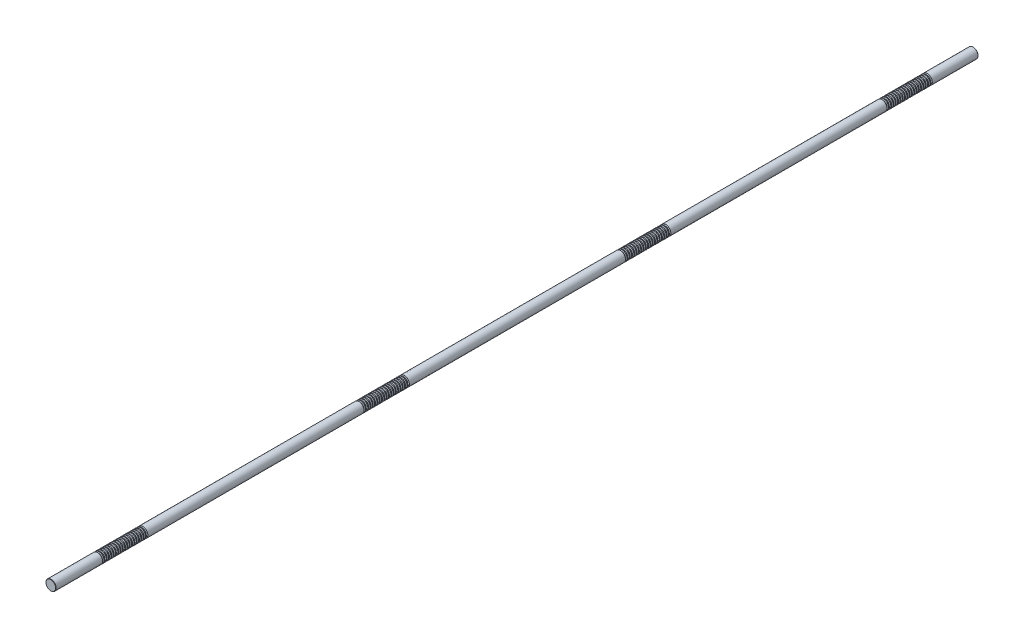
from build123d import *

# Parameters (mm, degrees)
SKETCH1_R           = 11
BOSS_EXTRUDE1_DEPTH = 1000
CHAMFER1_SIZE       = 0.55
LPATTERN1_COUNT     = 20
LPATTERN1_PITCH     = 5
LPATTERN2_COUNT     = 4
LPATTERN2_PITCH     = 567


with BuildPart() as part:
    # Sketch1 → Boss-Extrude1 (new, symmetric)
    with BuildSketch(Plane.XY):
        Circle(SKETCH1_R)
    extrude(amount=BOSS_EXTRUDE1_DEPTH, both=True)

    # Chamfer1
    chamfer1_edges = [part.edges().sort_by_distance(p)[0] for p in [
        (-11, 0, -1000),
        (-11, 0, 1000),
    ]]
    chamfer(chamfer1_edges, length=CHAMFER1_SIZE)

    # Sketch2 → Cut-Revolve1 (revolve, cut)
    with BuildSketch(Plane(origin=(0, 0, 0), x_dir=(0, 0, -1), z_dir=(1, 0, 0)), mode=Mode.PRIVATE) as cut_revolve1_sk:
        Polygon((900.36843014, 11), (897.13156986, 11), (897.86843014, 8.25), (899.63156986, 8.25), align=None)
    cut_revolve1 = revolve(cut_revolve1_sk.sketch.rotate(Axis((0, 0, 1000), (0, 0, -1)), 90), axis=Axis((0, 0, 1000), (0, 0, -1)), mode=Mode.SUBTRACT)

    # LPattern1: Cut-Revolve1 ×20
    with Locations(*[(0, 0, i * LPATTERN1_PITCH) for i in range(1, LPATTERN1_COUNT)]):
        add(cut_revolve1, mode=Mode.SUBTRACT)

    # LPattern2: Cut-Revolve1 ×4
    with Locations(*[(0, 0, i * LPATTERN2_PITCH) for i in range(1, LPATTERN2_COUNT)]):
        add(cut_revolve1, mode=Mode.SUBTRACT)

    # LPattern2 copy 1 sketch → LPattern2 copy 1 (revolve, cut)
    with BuildSketch(Plane(origin=(0, 0, 572), x_dir=(0, 0, -1), z_dir=(1, 0, 0))):
        Polygon((900.36843014, 11), (897.13156986, 11), (897.86843014, 8.25), (899.63156986, 8.25), align=None)
    revolve(axis=Axis((0, 0, 1572), (0, 0, -1)), mode=Mode.SUBTRACT)

    # LPattern2 copy 2 sketch → LPattern2 copy 2 (revolve, cut)
    with BuildSketch(Plane(origin=(0, 0, 1139), x_dir=(0, 0, -1), z_dir=(1, 0, 0))):
        Polygon((900.36843014, 11), (897.13156986, 11), (897.86843014, 8.25), (899.63156986, 8.25), align=None)
    revolve(axis=Axis((0, 0, 2139), (0, 0, -1)), mode=Mode.SUBTRACT)

    # LPattern2 copy 3 sketch → LPattern2 copy 3 (revolve, cut)
    with BuildSketch(Plane(origin=(0, 0, 1706), x_dir=(0, 0, -1), z_dir=(1, 0, 0))):
        Polygon((900.36843014, 11), (897.13156986, 11), (897.86843014, 8.25), (899.63156986, 8.25), align=None)
    revolve(axis=Axis((0, 0, 2706), (0, 0, -1)), mode=Mode.SUBTRACT)

    # LPattern2 copy 4 sketch → LPattern2 copy 4 (revolve, cut)
    with BuildSketch(Plane(origin=(0, 0, 577), x_dir=(0, 0, -1), z_dir=(1, 0, 0))):
        Polygon((900.36843014, 11), (897.13156986, 11), (897.86843014, 8.25), (899.63156986, 8.25), align=None)
    revolve(axis=Axis((0, 0, 1577), (0, 0, -1)), mode=Mode.SUBTRACT)

    # LPattern2 copy 5 sketch → LPattern2 copy 5 (revolve, cut)
    with BuildSketch(Plane(origin=(0, 0, 1144), x_dir=(0, 0, -1), z_dir=(1, 0, 0))):
        Polygon((900.36843014, 11), (897.13156986, 11), (897.86843014, 8.25), (899.63156986, 8.25), align=None)
    revolve(axis=Axis((0, 0, 2144), (0, 0, -1)), mode=Mode.SUBTRACT)

    # LPattern2 copy 6 sketch → LPattern2 copy 6 (revolve, cut)
    with BuildSketch(Plane(origin=(0, 0, 1711), x_dir=(0, 0, -1), z_dir=(1, 0, 0))):
        Polygon((900.36843014, 11), (897.13156986, 11), (897.86843014, 8.25), (899.63156986, 8.25), align=None)
    revolve(axis=Axis((0, 0, 2711), (0, 0, -1)), mode=Mode.SUBTRACT)

    # LPattern2 copy 7 sketch → LPattern2 copy 7 (revolve, cut)
    with BuildSketch(Plane(origin=(0, 0, 582), x_dir=(0, 0, -1), z_dir=(1, 0, 0))):
        Polygon((900.36843014, 11), (897.13156986, 11), (897.86843014, 8.25), (899.63156986, 8.25), align=None)
    revolve(axis=Axis((0, 0, 1582), (0, 0, -1)), mode=Mode.SUBTRACT)

    # LPattern2 copy 8 sketch → LPattern2 copy 8 (revolve, cut)
    with BuildSketch(Plane(origin=(0, 0, 1149), x_dir=(0, 0, -1), z_dir=(1, 0, 0))):
        Polygon((900.36843014, 11), (897.13156986, 11), (897.86843014, 8.25), (899.63156986, 8.25), align=None)
    revolve(axis=Axis((0, 0, 2149), (0, 0, -1)), mode=Mode.SUBTRACT)

    # LPattern2 copy 9 sketch → LPattern2 copy 9 (revolve, cut)
    with BuildSketch(Plane(origin=(0, 0, 1716), x_dir=(0, 0, -1), z_dir=(1, 0, 0))):
        Polygon((900.36843014, 11), (897.13156986, 11), (897.86843014, 8.25), (899.63156986, 8.25), align=None)
    revolve(axis=Axis((0, 0, 2716), (0, 0, -1)), mode=Mode.SUBTRACT)

    # LPattern2 copy 10 sketch → LPattern2 copy 10 (revolve, cut)
    with BuildSketch(Plane(origin=(0, 0, 587), x_dir=(0, 0, -1), z_dir=(1, 0, 0))):
        Polygon((900.36843014, 11), (897.13156986, 11), (897.86843014, 8.25), (899.63156986, 8.25), align=None)
    revolve(axis=Axis((0, 0, 1587), (0, 0, -1)), mode=Mode.SUBTRACT)

    # LPattern2 copy 11 sketch → LPattern2 copy 11 (revolve, cut)
    with BuildSketch(Plane(origin=(0, 0, 1154), x_dir=(0, 0, -1), z_dir=(1, 0, 0))):
        Polygon((900.36843014, 11), (897.13156986, 11), (897.86843014, 8.25), (899.63156986, 8.25), align=None)
    revolve(axis=Axis((0, 0, 2154), (0, 0, -1)), mode=Mode.SUBTRACT)

    # LPattern2 copy 12 sketch → LPattern2 copy 12 (revolve, cut)
    with BuildSketch(Plane(origin=(0, 0, 1721), x_dir=(0, 0, -1), z_dir=(1, 0, 0))):
        Polygon((900.36843014, 11), (897.13156986, 11), (897.86843014, 8.25), (899.63156986, 8.25), align=None)
    revolve(axis=Axis((0, 0, 2721), (0, 0, -1)), mode=Mode.SUBTRACT)

    # LPattern2 copy 13 sketch → LPattern2 copy 13 (revolve, cut)
    with BuildSketch(Plane(origin=(0, 0, 592), x_dir=(0, 0, -1), z_dir=(1, 0, 0))):
        Polygon((900.36843014, 11), (897.13156986, 11), (897.86843014, 8.25), (899.63156986, 8.25), align=None)
    revolve(axis=Axis((0, 0, 1592), (0, 0, -1)), mode=Mode.SUBTRACT)

    # LPattern2 copy 14 sketch → LPattern2 copy 14 (revolve, cut)
    with BuildSketch(Plane(origin=(0, 0, 1159), x_dir=(0, 0, -1), z_dir=(1, 0, 0))):
        Polygon((900.36843014, 11), (897.13156986, 11), (897.86843014, 8.25), (899.63156986, 8.25), align=None)
    revolve(axis=Axis((0, 0, 2159), (0, 0, -1)), mode=Mode.SUBTRACT)

    # LPattern2 copy 15 sketch → LPattern2 copy 15 (revolve, cut)
    with BuildSketch(Plane(origin=(0, 0, 1726), x_dir=(0, 0, -1), z_dir=(1, 0, 0))):
        Polygon((900.36843014, 11), (897.13156986, 11), (897.86843014, 8.25), (899.63156986, 8.25), align=None)
    revolve(axis=Axis((0, 0, 2726), (0, 0, -1)), mode=Mode.SUBTRACT)

    # LPattern2 copy 16 sketch → LPattern2 copy 16 (revolve, cut)
    with BuildSketch(Plane(origin=(0, 0, 597), x_dir=(0, 0, -1), z_dir=(1, 0, 0))):
        Polygon((900.36843014, 11), (897.13156986, 11), (897.86843014, 8.25), (899.63156986, 8.25), align=None)
    revolve(axis=Axis((0, 0, 1597), (0, 0, -1)), mode=Mode.SUBTRACT)

    # LPattern2 copy 17 sketch → LPattern2 copy 17 (revolve, cut)
    with BuildSketch(Plane(origin=(0, 0, 1164), x_dir=(0, 0, -1), z_dir=(1, 0, 0))):
        Polygon((900.36843014, 11), (897.13156986, 11), (897.86843014, 8.25), (899.63156986, 8.25), align=None)
    revolve(axis=Axis((0, 0, 2164), (0, 0, -1)), mode=Mode.SUBTRACT)

    # LPattern2 copy 18 sketch → LPattern2 copy 18 (revolve, cut)
    with BuildSketch(Plane(origin=(0, 0, 1731), x_dir=(0, 0, -1), z_dir=(1, 0, 0))):
        Polygon((900.36843014, 11), (897.13156986, 11), (897.86843014, 8.25), (899.63156986, 8.25), align=None)
    revolve(axis=Axis((0, 0, 2731), (0, 0, -1)), mode=Mode.SUBTRACT)

    # LPattern2 copy 19 sketch → LPattern2 copy 19 (revolve, cut)
    with BuildSketch(Plane(origin=(0, 0, 602), x_dir=(0, 0, -1), z_dir=(1, 0, 0))):
        Polygon((900.36843014, 11), (897.13156986, 11), (897.86843014, 8.25), (899.63156986, 8.25), align=None)
    revolve(axis=Axis((0, 0, 1602), (0, 0, -1)), mode=Mode.SUBTRACT)

    # LPattern2 copy 20 sketch → LPattern2 copy 20 (revolve, cut)
    with BuildSketch(Plane(origin=(0, 0, 1169), x_dir=(0, 0, -1), z_dir=(1, 0, 0))):
        Polygon((900.36843014, 11), (897.13156986, 11), (897.86843014, 8.25), (899.63156986, 8.25), align=None)
    revolve(axis=Axis((0, 0, 2169), (0, 0, -1)), mode=Mode.SUBTRACT)

    # LPattern2 copy 21 sketch → LPattern2 copy 21 (revolve, cut)
    with BuildSketch(Plane(origin=(0, 0, 1736), x_dir=(0, 0, -1), z_dir=(1, 0, 0))):
        Polygon((900.36843014, 11), (897.13156986, 11), (897.86843014, 8.25), (899.63156986, 8.25), align=None)
    revolve(axis=Axis((0, 0, 2736), (0, 0, -1)), mode=Mode.SUBTRACT)

    # LPattern2 copy 22 sketch → LPattern2 copy 22 (revolve, cut)
    with BuildSketch(Plane(origin=(0, 0, 607), x_dir=(0, 0, -1), z_dir=(1, 0, 0))):
        Polygon((900.36843014, 11), (897.13156986, 11), (897.86843014, 8.25), (899.63156986, 8.25), align=None)
    revolve(axis=Axis((0, 0, 1607), (0, 0, -1)), mode=Mode.SUBTRACT)

    # LPattern2 copy 23 sketch → LPattern2 copy 23 (revolve, cut)
    with BuildSketch(Plane(origin=(0, 0, 1174), x_dir=(0, 0, -1), z_dir=(1, 0, 0))):
        Polygon((900.36843014, 11), (897.13156986, 11), (897.86843014, 8.25), (899.63156986, 8.25), align=None)
    revolve(axis=Axis((0, 0, 2174), (0, 0, -1)), mode=Mode.SUBTRACT)

    # LPattern2 copy 24 sketch → LPattern2 copy 24 (revolve, cut)
    with BuildSketch(Plane(origin=(0, 0, 1741), x_dir=(0, 0, -1), z_dir=(1, 0, 0))):
        Polygon((900.36843014, 11), (897.13156986, 11), (897.86843014, 8.25), (899.63156986, 8.25), align=None)
    revolve(axis=Axis((0, 0, 2741), (0, 0, -1)), mode=Mode.SUBTRACT)

    # LPattern2 copy 25 sketch → LPattern2 copy 25 (revolve, cut)
    with BuildSketch(Plane(origin=(0, 0, 612), x_dir=(0, 0, -1), z_dir=(1, 0, 0))):
        Polygon((900.36843014, 11), (897.13156986, 11), (897.86843014, 8.25), (899.63156986, 8.25), align=None)
    revolve(axis=Axis((0, 0, 1612), (0, 0, -1)), mode=Mode.SUBTRACT)

    # LPattern2 copy 26 sketch → LPattern2 copy 26 (revolve, cut)
    with BuildSketch(Plane(origin=(0, 0, 1179), x_dir=(0, 0, -1), z_dir=(1, 0, 0))):
        Polygon((900.36843014, 11), (897.13156986, 11), (897.86843014, 8.25), (899.63156986, 8.25), align=None)
    revolve(axis=Axis((0, 0, 2179), (0, 0, -1)), mode=Mode.SUBTRACT)

    # LPattern2 copy 27 sketch → LPattern2 copy 27 (revolve, cut)
    with BuildSketch(Plane(origin=(0, 0, 1746), x_dir=(0, 0, -1), z_dir=(1, 0, 0))):
        Polygon((900.36843014, 11), (897.13156986, 11), (897.86843014, 8.25), (899.63156986, 8.25), align=None)
    revolve(axis=Axis((0, 0, 2746), (0, 0, -1)), mode=Mode.SUBTRACT)

    # LPattern2 copy 28 sketch → LPattern2 copy 28 (revolve, cut)
    with BuildSketch(Plane(origin=(0, 0, 617), x_dir=(0, 0, -1), z_dir=(1, 0, 0))):
        Polygon((900.36843014, 11), (897.13156986, 11), (897.86843014, 8.25), (899.63156986, 8.25), align=None)
    revolve(axis=Axis((0, 0, 1617), (0, 0, -1)), mode=Mode.SUBTRACT)

    # LPattern2 copy 29 sketch → LPattern2 copy 29 (revolve, cut)
    with BuildSketch(Plane(origin=(0, 0, 1184), x_dir=(0, 0, -1), z_dir=(1, 0, 0))):
        Polygon((900.36843014, 11), (897.13156986, 11), (897.86843014, 8.25), (899.63156986, 8.25), align=None)
    revolve(axis=Axis((0, 0, 2184), (0, 0, -1)), mode=Mode.SUBTRACT)

    # LPattern2 copy 30 sketch → LPattern2 copy 30 (revolve, cut)
    with BuildSketch(Plane(origin=(0, 0, 1751), x_dir=(0, 0, -1), z_dir=(1, 0, 0))):
        Polygon((900.36843014, 11), (897.13156986, 11), (897.86843014, 8.25), (899.63156986, 8.25), align=None)
    revolve(axis=Axis((0, 0, 2751), (0, 0, -1)), mode=Mode.SUBTRACT)

    # LPattern2 copy 31 sketch → LPattern2 copy 31 (revolve, cut)
    with BuildSketch(Plane(origin=(0, 0, 622), x_dir=(0, 0, -1), z_dir=(1, 0, 0))):
        Polygon((900.36843014, 11), (897.13156986, 11), (897.86843014, 8.25), (899.63156986, 8.25), align=None)
    revolve(axis=Axis((0, 0, 1622), (0, 0, -1)), mode=Mode.SUBTRACT)

    # LPattern2 copy 32 sketch → LPattern2 copy 32 (revolve, cut)
    with BuildSketch(Plane(origin=(0, 0, 1189), x_dir=(0, 0, -1), z_dir=(1, 0, 0))):
        Polygon((900.36843014, 11), (897.13156986, 11), (897.86843014, 8.25), (899.63156986, 8.25), align=None)
    revolve(axis=Axis((0, 0, 2189), (0, 0, -1)), mode=Mode.SUBTRACT)

    # LPattern2 copy 33 sketch → LPattern2 copy 33 (revolve, cut)
    with BuildSketch(Plane(origin=(0, 0, 1756), x_dir=(0, 0, -1), z_dir=(1, 0, 0))):
        Polygon((900.36843014, 11), (897.13156986, 11), (897.86843014, 8.25), (899.63156986, 8.25), align=None)
    revolve(axis=Axis((0, 0, 2756), (0, 0, -1)), mode=Mode.SUBTRACT)

    # LPattern2 copy 34 sketch → LPattern2 copy 34 (revolve, cut)
    with BuildSketch(Plane(origin=(0, 0, 627), x_dir=(0, 0, -1), z_dir=(1, 0, 0))):
        Polygon((900.36843014, 11), (897.13156986, 11), (897.86843014, 8.25), (899.63156986, 8.25), align=None)
    revolve(axis=Axis((0, 0, 1627), (0, 0, -1)), mode=Mode.SUBTRACT)

    # LPattern2 copy 35 sketch → LPattern2 copy 35 (revolve, cut)
    with BuildSketch(Plane(origin=(0, 0, 1194), x_dir=(0, 0, -1), z_dir=(1, 0, 0))):
        Polygon((900.36843014, 11), (897.13156986, 11), (897.86843014, 8.25), (899.63156986, 8.25), align=None)
    revolve(axis=Axis((0, 0, 2194), (0, 0, -1)), mode=Mode.SUBTRACT)

    # LPattern2 copy 36 sketch → LPattern2 copy 36 (revolve, cut)
    with BuildSketch(Plane(origin=(0, 0, 1761), x_dir=(0, 0, -1), z_dir=(1, 0, 0))):
        Polygon((900.36843014, 11), (897.13156986, 11), (897.86843014, 8.25), (899.63156986, 8.25), align=None)
    revolve(axis=Axis((0, 0, 2761), (0, 0, -1)), mode=Mode.SUBTRACT)

    # LPattern2 copy 37 sketch → LPattern2 copy 37 (revolve, cut)
    with BuildSketch(Plane(origin=(0, 0, 632), x_dir=(0, 0, -1), z_dir=(1, 0, 0))):
        Polygon((900.36843014, 11), (897.13156986, 11), (897.86843014, 8.25), (899.63156986, 8.25), align=None)
    revolve(axis=Axis((0, 0, 1632), (0, 0, -1)), mode=Mode.SUBTRACT)

    # LPattern2 copy 38 sketch → LPattern2 copy 38 (revolve, cut)
    with BuildSketch(Plane(origin=(0, 0, 1199), x_dir=(0, 0, -1), z_dir=(1, 0, 0))):
        Polygon((900.36843014, 11), (897.13156986, 11), (897.86843014, 8.25), (899.63156986, 8.25), align=None)
    revolve(axis=Axis((0, 0, 2199), (0, 0, -1)), mode=Mode.SUBTRACT)

    # LPattern2 copy 39 sketch → LPattern2 copy 39 (revolve, cut)
    with BuildSketch(Plane(origin=(0, 0, 1766), x_dir=(0, 0, -1), z_dir=(1, 0, 0))):
        Polygon((900.36843014, 11), (897.13156986, 11), (897.86843014, 8.25), (899.63156986, 8.25), align=None)
    revolve(axis=Axis((0, 0, 2766), (0, 0, -1)), mode=Mode.SUBTRACT)

    # LPattern2 copy 40 sketch → LPattern2 copy 40 (revolve, cut)
    with BuildSketch(Plane(origin=(0, 0, 637), x_dir=(0, 0, -1), z_dir=(1, 0, 0))):
        Polygon((900.36843014, 11), (897.13156986, 11), (897.86843014, 8.25), (899.63156986, 8.25), align=None)
    revolve(axis=Axis((0, 0, 1637), (0, 0, -1)), mode=Mode.SUBTRACT)

    # LPattern2 copy 41 sketch → LPattern2 copy 41 (revolve, cut)
    with BuildSketch(Plane(origin=(0, 0, 1204), x_dir=(0, 0, -1), z_dir=(1, 0, 0))):
        Polygon((900.36843014, 11), (897.13156986, 11), (897.86843014, 8.25), (899.63156986, 8.25), align=None)
    revolve(axis=Axis((0, 0, 2204), (0, 0, -1)), mode=Mode.SUBTRACT)

    # LPattern2 copy 42 sketch → LPattern2 copy 42 (revolve, cut)
    with BuildSketch(Plane(origin=(0, 0, 1771), x_dir=(0, 0, -1), z_dir=(1, 0, 0))):
        Polygon((900.36843014, 11), (897.13156986, 11), (897.86843014, 8.25), (899.63156986, 8.25), align=None)
    revolve(axis=Axis((0, 0, 2771), (0, 0, -1)), mode=Mode.SUBTRACT)

    # LPattern2 copy 43 sketch → LPattern2 copy 43 (revolve, cut)
    with BuildSketch(Plane(origin=(0, 0, 642), x_dir=(0, 0, -1), z_dir=(1, 0, 0))):
        Polygon((900.36843014, 11), (897.13156986, 11), (897.86843014, 8.25), (899.63156986, 8.25), align=None)
    revolve(axis=Axis((0, 0, 1642), (0, 0, -1)), mode=Mode.SUBTRACT)

    # LPattern2 copy 44 sketch → LPattern2 copy 44 (revolve, cut)
    with BuildSketch(Plane(origin=(0, 0, 1209), x_dir=(0, 0, -1), z_dir=(1, 0, 0))):
        Polygon((900.36843014, 11), (897.13156986, 11), (897.86843014, 8.25), (899.63156986, 8.25), align=None)
    revolve(axis=Axis((0, 0, 2209), (0, 0, -1)), mode=Mode.SUBTRACT)

    # LPattern2 copy 45 sketch → LPattern2 copy 45 (revolve, cut)
    with BuildSketch(Plane(origin=(0, 0, 1776), x_dir=(0, 0, -1), z_dir=(1, 0, 0))):
        Polygon((900.36843014, 11), (897.13156986, 11), (897.86843014, 8.25), (899.63156986, 8.25), align=None)
    revolve(axis=Axis((0, 0, 2776), (0, 0, -1)), mode=Mode.SUBTRACT)

    # LPattern2 copy 46 sketch → LPattern2 copy 46 (revolve, cut)
    with BuildSketch(Plane(origin=(0, 0, 647), x_dir=(0, 0, -1), z_dir=(1, 0, 0))):
        Polygon((900.36843014, 11), (897.13156986, 11), (897.86843014, 8.25), (899.63156986, 8.25), align=None)
    revolve(axis=Axis((0, 0, 1647), (0, 0, -1)), mode=Mode.SUBTRACT)

    # LPattern2 copy 47 sketch → LPattern2 copy 47 (revolve, cut)
    with BuildSketch(Plane(origin=(0, 0, 1214), x_dir=(0, 0, -1), z_dir=(1, 0, 0))):
        Polygon((900.36843014, 11), (897.13156986, 11), (897.86843014, 8.25), (899.63156986, 8.25), align=None)
    revolve(axis=Axis((0, 0, 2214), (0, 0, -1)), mode=Mode.SUBTRACT)

    # LPattern2 copy 48 sketch → LPattern2 copy 48 (revolve, cut)
    with BuildSketch(Plane(origin=(0, 0, 1781), x_dir=(0, 0, -1), z_dir=(1, 0, 0))):
        Polygon((900.36843014, 11), (897.13156986, 11), (897.86843014, 8.25), (899.63156986, 8.25), align=None)
    revolve(axis=Axis((0, 0, 2781), (0, 0, -1)), mode=Mode.SUBTRACT)

    # LPattern2 copy 49 sketch → LPattern2 copy 49 (revolve, cut)
    with BuildSketch(Plane(origin=(0, 0, 652), x_dir=(0, 0, -1), z_dir=(1, 0, 0))):
        Polygon((900.36843014, 11), (897.13156986, 11), (897.86843014, 8.25), (899.63156986, 8.25), align=None)
    revolve(axis=Axis((0, 0, 1652), (0, 0, -1)), mode=Mode.SUBTRACT)

    # LPattern2 copy 50 sketch → LPattern2 copy 50 (revolve, cut)
    with BuildSketch(Plane(origin=(0, 0, 1219), x_dir=(0, 0, -1), z_dir=(1, 0, 0))):
        Polygon((900.36843014, 11), (897.13156986, 11), (897.86843014, 8.25), (899.63156986, 8.25), align=None)
    revolve(axis=Axis((0, 0, 2219), (0, 0, -1)), mode=Mode.SUBTRACT)

    # LPattern2 copy 51 sketch → LPattern2 copy 51 (revolve, cut)
    with BuildSketch(Plane(origin=(0, 0, 1786), x_dir=(0, 0, -1), z_dir=(1, 0, 0))):
        Polygon((900.36843014, 11), (897.13156986, 11), (897.86843014, 8.25), (899.63156986, 8.25), align=None)
    revolve(axis=Axis((0, 0, 2786), (0, 0, -1)), mode=Mode.SUBTRACT)

    # LPattern2 copy 52 sketch → LPattern2 copy 52 (revolve, cut)
    with BuildSketch(Plane(origin=(0, 0, 657), x_dir=(0, 0, -1), z_dir=(1, 0, 0))):
        Polygon((900.36843014, 11), (897.13156986, 11), (897.86843014, 8.25), (899.63156986, 8.25), align=None)
    revolve(axis=Axis((0, 0, 1657), (0, 0, -1)), mode=Mode.SUBTRACT)

    # LPattern2 copy 53 sketch → LPattern2 copy 53 (revolve, cut)
    with BuildSketch(Plane(origin=(0, 0, 1224), x_dir=(0, 0, -1), z_dir=(1, 0, 0))):
        Polygon((900.36843014, 11), (897.13156986, 11), (897.86843014, 8.25), (899.63156986, 8.25), align=None)
    revolve(axis=Axis((0, 0, 2224), (0, 0, -1)), mode=Mode.SUBTRACT)

    # LPattern2 copy 54 sketch → LPattern2 copy 54 (revolve, cut)
    with BuildSketch(Plane(origin=(0, 0, 1791), x_dir=(0, 0, -1), z_dir=(1, 0, 0))):
        Polygon((900.36843014, 11), (897.13156986, 11), (897.86843014, 8.25), (899.63156986, 8.25), align=None)
    revolve(axis=Axis((0, 0, 2791), (0, 0, -1)), mode=Mode.SUBTRACT)

    # LPattern2 copy 55 sketch → LPattern2 copy 55 (revolve, cut)
    with BuildSketch(Plane(origin=(0, 0, 662), x_dir=(0, 0, -1), z_dir=(1, 0, 0))):
        Polygon((900.36843014, 11), (897.13156986, 11), (897.86843014, 8.25), (899.63156986, 8.25), align=None)
    revolve(axis=Axis((0, 0, 1662), (0, 0, -1)), mode=Mode.SUBTRACT)

    # LPattern2 copy 56 sketch → LPattern2 copy 56 (revolve, cut)
    with BuildSketch(Plane(origin=(0, 0, 1229), x_dir=(0, 0, -1), z_dir=(1, 0, 0))):
        Polygon((900.36843014, 11), (897.13156986, 11), (897.86843014, 8.25), (899.63156986, 8.25), align=None)
    revolve(axis=Axis((0, 0, 2229), (0, 0, -1)), mode=Mode.SUBTRACT)

    # LPattern2 copy 57 sketch → LPattern2 copy 57 (revolve, cut)
    with BuildSketch(Plane(origin=(0, 0, 1796), x_dir=(0, 0, -1), z_dir=(1, 0, 0))):
        Polygon((900.36843014, 11), (897.13156986, 11), (897.86843014, 8.25), (899.63156986, 8.25), align=None)
    revolve(axis=Axis((0, 0, 2796), (0, 0, -1)), mode=Mode.SUBTRACT)


solid = part.part
